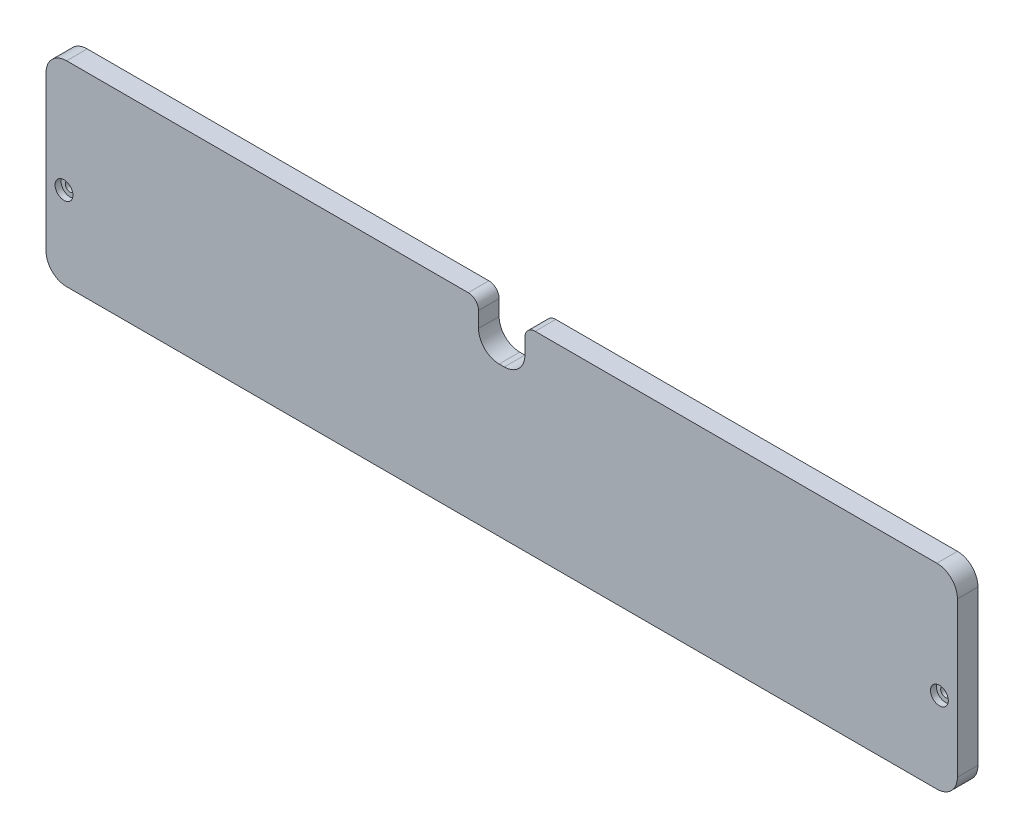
from build123d import *

# Parameters (mm, degrees)
BOSS_EXTRUDE1_DEPTH                              = 12.7
CBORE_FOR_M5_PAN_HEAD_MACHINE_SCREW1_D           = 5.8
CBORE_FOR_M5_PAN_HEAD_MACHINE_SCREW1_CBORE_D     = 11
CBORE_FOR_M5_PAN_HEAD_MACHINE_SCREW1_CBORE_DEPTH = 3.7


with BuildPart() as part:
    # Sketch1 → Boss-Extrude1 (new body)
    with BuildSketch(Plane.XY):
        with BuildLine():
            Line((12.7, 0), (549.275, 0))
            ThreePointArc((549.275, 0), (558.255256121, 3.719743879), (561.975, 12.7))
            Line((561.975, 12.7), (561.975, 107.95))
            ThreePointArc((561.975, 107.95), (558.255256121, 116.930256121), (549.275, 120.65))
            Line((549.275, 120.65), (301.625, 120.65))
            ThreePointArc((301.625, 120.65), (297.134871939, 118.790128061), (295.275, 114.3))
            Line((295.275, 114.3), (295.275, 104.775))
            ThreePointArc((295.275, 104.775), (291.555256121, 95.794743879), (282.575, 92.075))
            Line((282.575, 92.075), (279.4, 92.075))
            ThreePointArc((279.4, 92.075), (270.419743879, 95.794743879), (266.7, 104.775))
            Line((266.7, 104.775), (266.7, 114.3))
            ThreePointArc((266.7, 114.3), (264.840128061, 118.790128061), (260.35, 120.65))
            Line((260.35, 120.65), (12.7, 120.65))
            ThreePointArc((12.7, 120.65), (3.719743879, 116.930256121), (0, 107.95))
            Line((0, 107.95), (0, 12.7))
            ThreePointArc((0, 12.7), (3.719743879, 3.719743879), (12.7, 0))
        make_face()
    extrude(amount=BOSS_EXTRUDE1_DEPTH)

    # CBORE for M5 Pan Head Machine Screw1 (through all)
    with Locations(Plane.XY.offset(12.7)):
        with Locations((11.1125, 50.8), (550.8625, 50.8)):
            CounterBoreHole(CBORE_FOR_M5_PAN_HEAD_MACHINE_SCREW1_D / 2, CBORE_FOR_M5_PAN_HEAD_MACHINE_SCREW1_CBORE_D / 2, CBORE_FOR_M5_PAN_HEAD_MACHINE_SCREW1_CBORE_DEPTH)


solid = part.part
